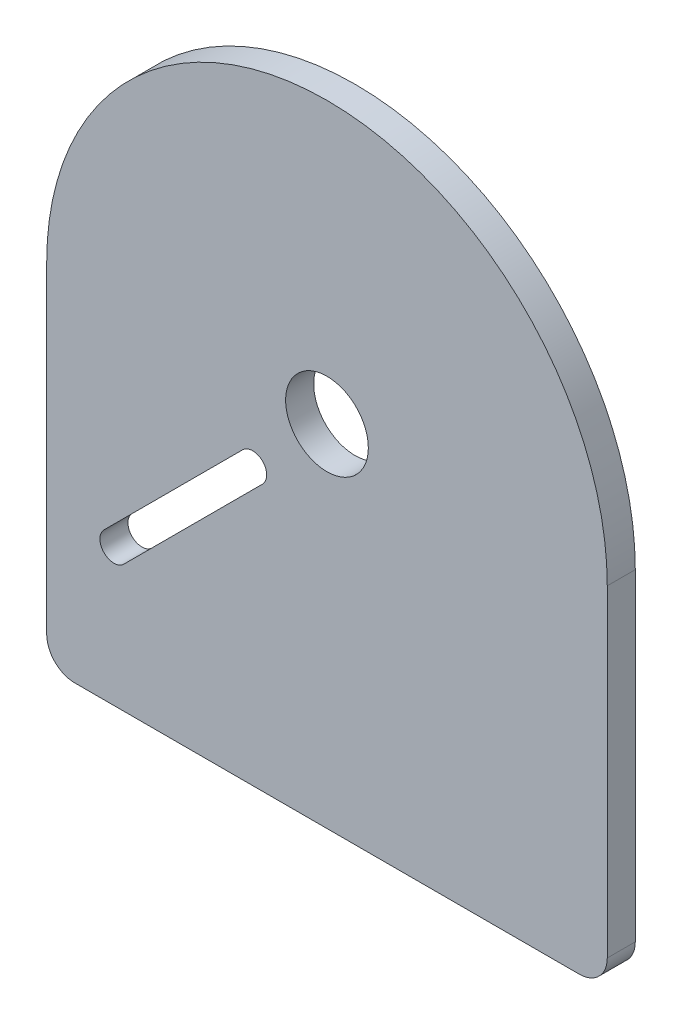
ISO-10303-21;
HEADER;
FILE_DESCRIPTION(('STEP AP214'),'2;1');
FILE_NAME('part.step','',(''),(''),'','','');
FILE_SCHEMA(('AUTOMOTIVE_DESIGN { 1 0 10303 214 1 1 1 1 }'));
ENDSEC;
DATA;
#1=APPLICATION_CONTEXT('core data for automotive mechanical design processes');
#2=APPLICATION_PROTOCOL_DEFINITION('international standard','automotive_design',2000,#1);
#3=PRODUCT_CONTEXT('',#1,'mechanical');
#4=PRODUCT('Part','Part','',(#3));
#5=PRODUCT_RELATED_PRODUCT_CATEGORY('part','',(#4));
#6=PRODUCT_DEFINITION_FORMATION('','',#4);
#7=PRODUCT_DEFINITION_CONTEXT('part definition',#1,'design');
#8=PRODUCT_DEFINITION('design','',#6,#7);
#9=PRODUCT_DEFINITION_SHAPE('','',#8);
#10=(LENGTH_UNIT() NAMED_UNIT(*) SI_UNIT(.MILLI.,.METRE.));
#11=(NAMED_UNIT(*) PLANE_ANGLE_UNIT() SI_UNIT($,.RADIAN.));
#12=(NAMED_UNIT(*) SI_UNIT($,.STERADIAN.) SOLID_ANGLE_UNIT());
#13=UNCERTAINTY_MEASURE_WITH_UNIT(LENGTH_MEASURE(1.E-05),#10,'distance_accuracy_value','');
#14=(GEOMETRIC_REPRESENTATION_CONTEXT(3) GLOBAL_UNCERTAINTY_ASSIGNED_CONTEXT((#13)) GLOBAL_UNIT_ASSIGNED_CONTEXT((#10,
#11,#12)) REPRESENTATION_CONTEXT('',''));
#15=CARTESIAN_POINT('',(0.,0.,0.));
#16=DIRECTION('',(0.,0.,1.));
#17=DIRECTION('',(1.,0.,0.));
#18=AXIS2_PLACEMENT_3D('',#15,#16,#17);
#19=CARTESIAN_POINT('',(-18.,-23.,1.99999999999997));
#20=DIRECTION('',(0.,0.,1.));
#21=DIRECTION('',(1.,0.,0.));
#22=AXIS2_PLACEMENT_3D('',#19,#20,#21);
#23=PLANE('',#22);
#24=CARTESIAN_POINT('',(0.,0.,2.));
#25=DIRECTION('',(0.,0.,1.));
#26=DIRECTION('',(1.,0.,0.));
#27=AXIS2_PLACEMENT_3D('',#24,#25,#26);
#28=CIRCLE('',#27,2.95);
#29=CARTESIAN_POINT('',(2.95,0.,2.));
#30=VERTEX_POINT('',#29);
#31=EDGE_CURVE('E150',#30,#30,#28,.T.);
#32=ORIENTED_EDGE('',*,*,#31,.F.);
#33=EDGE_LOOP('',(#32));
#34=FACE_BOUND('',#33,.T.);
#35=CARTESIAN_POINT('',(-18.,-23.,1.99999999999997));
#36=DIRECTION('',(0.,0.,1.));
#37=DIRECTION('',(1.,0.,0.));
#38=AXIS2_PLACEMENT_3D('',#35,#36,#37);
#39=CIRCLE('',#38,2.);
#40=CARTESIAN_POINT('',(-20.,-23.,1.99999999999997));
#41=VERTEX_POINT('',#40);
#42=CARTESIAN_POINT('',(-18.,-25.,1.99999999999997));
#43=VERTEX_POINT('',#42);
#44=EDGE_CURVE('E166',#41,#43,#39,.T.);
#45=ORIENTED_EDGE('',*,*,#44,.T.);
#46=DIRECTION('',(1.,0.,0.));
#47=VECTOR('',#46,1.);
#48=CARTESIAN_POINT('',(-18.,-25.,1.99999999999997));
#49=LINE('',#48,#47);
#50=CARTESIAN_POINT('',(18.,-25.,1.99999999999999));
#51=VERTEX_POINT('',#50);
#52=EDGE_CURVE('E169',#43,#51,#49,.T.);
#53=ORIENTED_EDGE('',*,*,#52,.T.);
#54=CARTESIAN_POINT('',(18.,-23.,1.99999999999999));
#55=DIRECTION('',(0.,0.,1.));
#56=DIRECTION('',(-1.,0.,0.));
#57=AXIS2_PLACEMENT_3D('',#54,#55,#56);
#58=CIRCLE('',#57,2.);
#59=CARTESIAN_POINT('',(20.,-23.,1.99999999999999));
#60=VERTEX_POINT('',#59);
#61=EDGE_CURVE('E171',#51,#60,#58,.T.);
#62=ORIENTED_EDGE('',*,*,#61,.T.);
#63=DIRECTION('',(0.,0.999999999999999,0.));
#64=VECTOR('',#63,1.);
#65=CARTESIAN_POINT('',(20.,0.,2.));
#66=LINE('',#65,#64);
#67=CARTESIAN_POINT('',(20.,0.,2.));
#68=VERTEX_POINT('',#67);
#69=EDGE_CURVE('E173',#60,#68,#66,.T.);
#70=ORIENTED_EDGE('',*,*,#69,.T.);
#71=CARTESIAN_POINT('',(0.,0.,2.));
#72=DIRECTION('',(0.,0.,1.));
#73=DIRECTION('',(1.,0.,0.));
#74=AXIS2_PLACEMENT_3D('',#71,#72,#73);
#75=CIRCLE('',#74,20.);
#76=CARTESIAN_POINT('',(-20.,0.,1.99999999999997));
#77=VERTEX_POINT('',#76);
#78=EDGE_CURVE('E175',#68,#77,#75,.T.);
#79=ORIENTED_EDGE('',*,*,#78,.T.);
#80=DIRECTION('',(0.,-0.999999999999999,0.));
#81=VECTOR('',#80,1.);
#82=CARTESIAN_POINT('',(-20.,0.,1.99999999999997));
#83=LINE('',#82,#81);
#84=EDGE_CURVE('E177',#77,#41,#83,.T.);
#85=ORIENTED_EDGE('',*,*,#84,.T.);
#86=EDGE_LOOP('',(#45,#53,#62,#70,#79,#85));
#87=FACE_BOUND('',#86,.T.);
#88=DIRECTION('',(-0.70710678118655,-0.707106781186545,0.));
#89=VECTOR('',#88,1.);
#90=CARTESIAN_POINT('',(-6.01040764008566,-4.59619407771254,1.99999999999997));
#91=LINE('',#90,#89);
#92=CARTESIAN_POINT('',(-6.01040764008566,-4.59619407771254,1.99999999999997));
#93=VERTEX_POINT('',#92);
#94=CARTESIAN_POINT('',(-15.9099025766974,-14.4956890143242,1.99999999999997));
#95=VERTEX_POINT('',#94);
#96=EDGE_CURVE('E138',#93,#95,#91,.T.);
#97=ORIENTED_EDGE('',*,*,#96,.F.);
#98=CARTESIAN_POINT('',(-5.30330085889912,-5.30330085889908,1.99999999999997));
#99=DIRECTION('',(0.,0.,1.));
#100=DIRECTION('',(1.,0.,0.));
#101=AXIS2_PLACEMENT_3D('',#98,#99,#100);
#102=CIRCLE('',#101,1.);
#103=CARTESIAN_POINT('',(-4.59619407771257,-6.01040764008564,1.99999999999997));
#104=VERTEX_POINT('',#103);
#105=EDGE_CURVE('E127',#104,#93,#102,.T.);
#106=ORIENTED_EDGE('',*,*,#105,.F.);
#107=DIRECTION('',(0.707106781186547,0.707106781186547,0.));
#108=VECTOR('',#107,1.);
#109=CARTESIAN_POINT('',(-14.4956890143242,-15.9099025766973,1.99999999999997));
#110=LINE('',#109,#108);
#111=CARTESIAN_POINT('',(-14.4956890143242,-15.9099025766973,1.99999999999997));
#112=VERTEX_POINT('',#111);
#113=EDGE_CURVE('E142',#112,#104,#110,.T.);
#114=ORIENTED_EDGE('',*,*,#113,.F.);
#115=CARTESIAN_POINT('',(-15.2027957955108,-15.2027957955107,1.99999999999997));
#116=DIRECTION('',(0.,0.,1.));
#117=DIRECTION('',(1.,0.,0.));
#118=AXIS2_PLACEMENT_3D('',#115,#116,#117);
#119=CIRCLE('',#118,1.00000000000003);
#120=EDGE_CURVE('E140',#95,#112,#119,.T.);
#121=ORIENTED_EDGE('',*,*,#120,.F.);
#122=EDGE_LOOP('',(#97,#106,#114,#121));
#123=FACE_BOUND('',#122,.T.);
#124=ADVANCED_FACE('F35',(#34,#87,#123),#23,.T.);
#125=CARTESIAN_POINT('',(-18.,-23.,0.));
#126=DIRECTION('',(0.,0.,1.));
#127=DIRECTION('',(1.,0.,0.));
#128=AXIS2_PLACEMENT_3D('',#125,#126,#127);
#129=PLANE('',#128);
#130=CARTESIAN_POINT('',(0.,0.,0.));
#131=DIRECTION('',(0.,0.,1.));
#132=DIRECTION('',(1.,0.,0.));
#133=AXIS2_PLACEMENT_3D('',#130,#131,#132);
#134=CIRCLE('',#133,2.95);
#135=CARTESIAN_POINT('',(2.95,0.,0.));
#136=VERTEX_POINT('',#135);
#137=EDGE_CURVE('E128',#136,#136,#134,.T.);
#138=ORIENTED_EDGE('',*,*,#137,.T.);
#139=EDGE_LOOP('',(#138));
#140=FACE_BOUND('',#139,.T.);
#141=CARTESIAN_POINT('',(-18.,-23.,0.));
#142=DIRECTION('',(0.,0.,1.));
#143=DIRECTION('',(1.,0.,0.));
#144=AXIS2_PLACEMENT_3D('',#141,#142,#143);
#145=CIRCLE('',#144,2.);
#146=CARTESIAN_POINT('',(-20.,-23.,0.));
#147=VERTEX_POINT('',#146);
#148=CARTESIAN_POINT('',(-18.,-25.,0.));
#149=VERTEX_POINT('',#148);
#150=EDGE_CURVE('E153',#147,#149,#145,.T.);
#151=ORIENTED_EDGE('',*,*,#150,.F.);
#152=DIRECTION('',(0.,-0.999999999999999,0.));
#153=VECTOR('',#152,1.);
#154=CARTESIAN_POINT('',(-20.,0.,0.));
#155=LINE('',#154,#153);
#156=CARTESIAN_POINT('',(-20.,0.,0.));
#157=VERTEX_POINT('',#156);
#158=EDGE_CURVE('E164',#157,#147,#155,.T.);
#159=ORIENTED_EDGE('',*,*,#158,.F.);
#160=CARTESIAN_POINT('',(0.,0.,0.));
#161=DIRECTION('',(0.,0.,1.));
#162=DIRECTION('',(1.,0.,0.));
#163=AXIS2_PLACEMENT_3D('',#160,#161,#162);
#164=CIRCLE('',#163,20.);
#165=CARTESIAN_POINT('',(20.,0.,0.));
#166=VERTEX_POINT('',#165);
#167=EDGE_CURVE('E162',#166,#157,#164,.T.);
#168=ORIENTED_EDGE('',*,*,#167,.F.);
#169=DIRECTION('',(0.,0.999999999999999,0.));
#170=VECTOR('',#169,1.);
#171=CARTESIAN_POINT('',(20.,0.,0.));
#172=LINE('',#171,#170);
#173=CARTESIAN_POINT('',(20.,-23.,0.));
#174=VERTEX_POINT('',#173);
#175=EDGE_CURVE('E160',#174,#166,#172,.T.);
#176=ORIENTED_EDGE('',*,*,#175,.F.);
#177=CARTESIAN_POINT('',(18.,-23.,0.));
#178=DIRECTION('',(0.,0.,1.));
#179=DIRECTION('',(-1.,0.,0.));
#180=AXIS2_PLACEMENT_3D('',#177,#178,#179);
#181=CIRCLE('',#180,2.);
#182=CARTESIAN_POINT('',(18.,-25.,0.));
#183=VERTEX_POINT('',#182);
#184=EDGE_CURVE('E158',#183,#174,#181,.T.);
#185=ORIENTED_EDGE('',*,*,#184,.F.);
#186=DIRECTION('',(1.,0.,0.));
#187=VECTOR('',#186,1.);
#188=CARTESIAN_POINT('',(-18.,-25.,0.));
#189=LINE('',#188,#187);
#190=EDGE_CURVE('E156',#149,#183,#189,.T.);
#191=ORIENTED_EDGE('',*,*,#190,.F.);
#192=EDGE_LOOP('',(#151,#159,#168,#176,#185,#191));
#193=FACE_BOUND('',#192,.T.);
#194=CARTESIAN_POINT('',(-5.30330085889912,-5.30330085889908,0.));
#195=DIRECTION('',(0.,0.,1.));
#196=DIRECTION('',(1.,0.,0.));
#197=AXIS2_PLACEMENT_3D('',#194,#195,#196);
#198=CIRCLE('',#197,1.);
#199=CARTESIAN_POINT('',(-4.59619407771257,-6.01040764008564,0.));
#200=VERTEX_POINT('',#199);
#201=CARTESIAN_POINT('',(-6.01040764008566,-4.59619407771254,0.));
#202=VERTEX_POINT('',#201);
#203=EDGE_CURVE('E58',#200,#202,#198,.T.);
#204=ORIENTED_EDGE('',*,*,#203,.T.);
#205=DIRECTION('',(-0.70710678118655,-0.707106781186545,0.));
#206=VECTOR('',#205,1.);
#207=CARTESIAN_POINT('',(-6.01040764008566,-4.59619407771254,0.));
#208=LINE('',#207,#206);
#209=CARTESIAN_POINT('',(-15.9099025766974,-14.4956890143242,0.));
#210=VERTEX_POINT('',#209);
#211=EDGE_CURVE('E114',#202,#210,#208,.T.);
#212=ORIENTED_EDGE('',*,*,#211,.T.);
#213=CARTESIAN_POINT('',(-15.2027957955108,-15.2027957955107,0.));
#214=DIRECTION('',(0.,0.,1.));
#215=DIRECTION('',(1.,0.,0.));
#216=AXIS2_PLACEMENT_3D('',#213,#214,#215);
#217=CIRCLE('',#216,1.00000000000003);
#218=CARTESIAN_POINT('',(-14.4956890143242,-15.9099025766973,0.));
#219=VERTEX_POINT('',#218);
#220=EDGE_CURVE('E123',#210,#219,#217,.T.);
#221=ORIENTED_EDGE('',*,*,#220,.T.);
#222=DIRECTION('',(0.707106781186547,0.707106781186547,0.));
#223=VECTOR('',#222,1.);
#224=CARTESIAN_POINT('',(-14.4956890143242,-15.9099025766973,0.));
#225=LINE('',#224,#223);
#226=EDGE_CURVE('E132',#219,#200,#225,.T.);
#227=ORIENTED_EDGE('',*,*,#226,.T.);
#228=EDGE_LOOP('',(#204,#212,#221,#227));
#229=FACE_BOUND('',#228,.T.);
#230=ADVANCED_FACE('F131',(#140,#193,#229),#129,.F.);
#231=CARTESIAN_POINT('',(-18.,-23.,1.99999999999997));
#232=DIRECTION('',(0.,0.,-1.));
#233=DIRECTION('',(-1.,0.,0.));
#234=AXIS2_PLACEMENT_3D('',#231,#232,#233);
#235=CYLINDRICAL_SURFACE('',#234,2.);
#236=ORIENTED_EDGE('',*,*,#150,.T.);
#237=DIRECTION('',(0.,0.,-1.));
#238=VECTOR('',#237,1.);
#239=CARTESIAN_POINT('',(-18.,-25.,1.99999999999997));
#240=LINE('',#239,#238);
#241=EDGE_CURVE('E11',#43,#149,#240,.T.);
#242=ORIENTED_EDGE('',*,*,#241,.F.);
#243=ORIENTED_EDGE('',*,*,#44,.F.);
#244=DIRECTION('',(0.,0.,-1.));
#245=VECTOR('',#244,1.);
#246=CARTESIAN_POINT('',(-20.,-23.,1.99999999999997));
#247=LINE('',#246,#245);
#248=EDGE_CURVE('E179',#41,#147,#247,.T.);
#249=ORIENTED_EDGE('',*,*,#248,.T.);
#250=EDGE_LOOP('',(#236,#242,#243,#249));
#251=FACE_BOUND('',#250,.T.);
#252=ADVANCED_FACE('F37',(#251),#235,.T.);
#253=CARTESIAN_POINT('',(-18.,-25.,1.99999999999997));
#254=DIRECTION('',(0.,0.999999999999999,0.));
#255=DIRECTION('',(0.,0.,1.));
#256=AXIS2_PLACEMENT_3D('',#253,#254,#255);
#257=PLANE('',#256);
#258=ORIENTED_EDGE('',*,*,#190,.T.);
#259=DIRECTION('',(0.,0.,-1.));
#260=VECTOR('',#259,1.);
#261=CARTESIAN_POINT('',(18.,-25.,1.99999999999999));
#262=LINE('',#261,#260);
#263=EDGE_CURVE('E43',#51,#183,#262,.T.);
#264=ORIENTED_EDGE('',*,*,#263,.F.);
#265=ORIENTED_EDGE('',*,*,#52,.F.);
#266=ORIENTED_EDGE('',*,*,#241,.T.);
#267=EDGE_LOOP('',(#258,#264,#265,#266));
#268=FACE_BOUND('',#267,.T.);
#269=ADVANCED_FACE('F217',(#268),#257,.F.);
#270=CARTESIAN_POINT('',(18.,-23.,1.99999999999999));
#271=DIRECTION('',(0.,0.,-1.));
#272=DIRECTION('',(-1.,0.,0.));
#273=AXIS2_PLACEMENT_3D('',#270,#271,#272);
#274=CYLINDRICAL_SURFACE('',#273,2.);
#275=ORIENTED_EDGE('',*,*,#184,.T.);
#276=DIRECTION('',(0.,0.,-1.));
#277=VECTOR('',#276,1.);
#278=CARTESIAN_POINT('',(20.,-23.,1.99999999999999));
#279=LINE('',#278,#277);
#280=EDGE_CURVE('E188',#60,#174,#279,.T.);
#281=ORIENTED_EDGE('',*,*,#280,.F.);
#282=ORIENTED_EDGE('',*,*,#61,.F.);
#283=ORIENTED_EDGE('',*,*,#263,.T.);
#284=EDGE_LOOP('',(#275,#281,#282,#283));
#285=FACE_BOUND('',#284,.T.);
#286=ADVANCED_FACE('F195',(#285),#274,.T.);
#287=CARTESIAN_POINT('',(20.,0.,2.));
#288=DIRECTION('',(-1.,0.,0.));
#289=DIRECTION('',(0.,-0.999999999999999,0.));
#290=AXIS2_PLACEMENT_3D('',#287,#288,#289);
#291=PLANE('',#290);
#292=ORIENTED_EDGE('',*,*,#175,.T.);
#293=DIRECTION('',(0.,0.,-1.));
#294=VECTOR('',#293,1.);
#295=CARTESIAN_POINT('',(20.,0.,2.));
#296=LINE('',#295,#294);
#297=EDGE_CURVE('E185',#68,#166,#296,.T.);
#298=ORIENTED_EDGE('',*,*,#297,.F.);
#299=ORIENTED_EDGE('',*,*,#69,.F.);
#300=ORIENTED_EDGE('',*,*,#280,.T.);
#301=EDGE_LOOP('',(#292,#298,#299,#300));
#302=FACE_BOUND('',#301,.T.);
#303=ADVANCED_FACE('F205',(#302),#291,.F.);
#304=CARTESIAN_POINT('',(0.,0.,2.));
#305=DIRECTION('',(0.,0.,-1.));
#306=DIRECTION('',(-1.,0.,0.));
#307=AXIS2_PLACEMENT_3D('',#304,#305,#306);
#308=CYLINDRICAL_SURFACE('',#307,20.);
#309=ORIENTED_EDGE('',*,*,#167,.T.);
#310=DIRECTION('',(0.,0.,-1.));
#311=VECTOR('',#310,1.);
#312=CARTESIAN_POINT('',(-20.,0.,1.99999999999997));
#313=LINE('',#312,#311);
#314=EDGE_CURVE('E182',#77,#157,#313,.T.);
#315=ORIENTED_EDGE('',*,*,#314,.F.);
#316=ORIENTED_EDGE('',*,*,#78,.F.);
#317=ORIENTED_EDGE('',*,*,#297,.T.);
#318=EDGE_LOOP('',(#309,#315,#316,#317));
#319=FACE_BOUND('',#318,.T.);
#320=ADVANCED_FACE('F209',(#319),#308,.T.);
#321=CARTESIAN_POINT('',(-20.,0.,1.99999999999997));
#322=DIRECTION('',(1.,0.,0.));
#323=DIRECTION('',(0.,0.,-1.));
#324=AXIS2_PLACEMENT_3D('',#321,#322,#323);
#325=PLANE('',#324);
#326=ORIENTED_EDGE('',*,*,#158,.T.);
#327=ORIENTED_EDGE('',*,*,#248,.F.);
#328=ORIENTED_EDGE('',*,*,#84,.F.);
#329=ORIENTED_EDGE('',*,*,#314,.T.);
#330=EDGE_LOOP('',(#326,#327,#328,#329));
#331=FACE_BOUND('',#330,.T.);
#332=ADVANCED_FACE('F220',(#331),#325,.F.);
#333=CARTESIAN_POINT('',(0.,0.,2.));
#334=DIRECTION('',(0.,0.,-1.));
#335=DIRECTION('',(-1.,0.,0.));
#336=AXIS2_PLACEMENT_3D('',#333,#334,#335);
#337=CYLINDRICAL_SURFACE('',#336,2.95);
#338=ORIENTED_EDGE('',*,*,#31,.T.);
#339=EDGE_LOOP('',(#338));
#340=FACE_BOUND('',#339,.T.);
#341=ORIENTED_EDGE('',*,*,#137,.F.);
#342=EDGE_LOOP('',(#341));
#343=FACE_BOUND('',#342,.T.);
#344=ADVANCED_FACE('F222',(#340,#343),#337,.F.);
#345=CARTESIAN_POINT('',(-5.30330085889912,-5.30330085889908,1.99999999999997));
#346=DIRECTION('',(0.,0.,-1.));
#347=DIRECTION('',(-1.,0.,0.));
#348=AXIS2_PLACEMENT_3D('',#345,#346,#347);
#349=CYLINDRICAL_SURFACE('',#348,1.);
#350=ORIENTED_EDGE('',*,*,#203,.F.);
#351=DIRECTION('',(0.,0.,-1.));
#352=VECTOR('',#351,1.);
#353=CARTESIAN_POINT('',(-4.59619407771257,-6.01040764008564,1.99999999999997));
#354=LINE('',#353,#352);
#355=EDGE_CURVE('E144',#104,#200,#354,.T.);
#356=ORIENTED_EDGE('',*,*,#355,.F.);
#357=ORIENTED_EDGE('',*,*,#105,.T.);
#358=DIRECTION('',(0.,0.,-1.));
#359=VECTOR('',#358,1.);
#360=CARTESIAN_POINT('',(-6.01040764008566,-4.59619407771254,1.99999999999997));
#361=LINE('',#360,#359);
#362=EDGE_CURVE('E116',#93,#202,#361,.T.);
#363=ORIENTED_EDGE('',*,*,#362,.T.);
#364=EDGE_LOOP('',(#350,#356,#357,#363));
#365=FACE_BOUND('',#364,.T.);
#366=ADVANCED_FACE('F125',(#365),#349,.F.);
#367=CARTESIAN_POINT('',(-6.01040764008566,-4.59619407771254,1.99999999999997));
#368=DIRECTION('',(0.707106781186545,-0.707106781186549,0.));
#369=DIRECTION('',(0.70710678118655,0.707106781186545,0.));
#370=AXIS2_PLACEMENT_3D('',#367,#368,#369);
#371=PLANE('',#370);
#372=ORIENTED_EDGE('',*,*,#211,.F.);
#373=ORIENTED_EDGE('',*,*,#362,.F.);
#374=ORIENTED_EDGE('',*,*,#96,.T.);
#375=DIRECTION('',(0.,0.,-1.));
#376=VECTOR('',#375,1.);
#377=CARTESIAN_POINT('',(-15.9099025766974,-14.4956890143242,1.99999999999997));
#378=LINE('',#377,#376);
#379=EDGE_CURVE('E119',#95,#210,#378,.T.);
#380=ORIENTED_EDGE('',*,*,#379,.T.);
#381=EDGE_LOOP('',(#372,#373,#374,#380));
#382=FACE_BOUND('',#381,.T.);
#383=ADVANCED_FACE('F115',(#382),#371,.T.);
#384=CARTESIAN_POINT('',(-15.2027957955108,-15.2027957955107,1.99999999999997));
#385=DIRECTION('',(0.,0.,-1.));
#386=DIRECTION('',(-1.,0.,0.));
#387=AXIS2_PLACEMENT_3D('',#384,#385,#386);
#388=CYLINDRICAL_SURFACE('',#387,1.00000000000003);
#389=ORIENTED_EDGE('',*,*,#220,.F.);
#390=ORIENTED_EDGE('',*,*,#379,.F.);
#391=ORIENTED_EDGE('',*,*,#120,.T.);
#392=DIRECTION('',(0.,0.,-1.));
#393=VECTOR('',#392,1.);
#394=CARTESIAN_POINT('',(-14.4956890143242,-15.9099025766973,1.99999999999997));
#395=LINE('',#394,#393);
#396=EDGE_CURVE('E50',#112,#219,#395,.T.);
#397=ORIENTED_EDGE('',*,*,#396,.T.);
#398=EDGE_LOOP('',(#389,#390,#391,#397));
#399=FACE_BOUND('',#398,.T.);
#400=ADVANCED_FACE('F245',(#399),#388,.F.);
#401=CARTESIAN_POINT('',(-14.4956890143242,-15.9099025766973,1.99999999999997));
#402=DIRECTION('',(-0.707106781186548,0.707106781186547,0.));
#403=DIRECTION('',(-0.707106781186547,-0.707106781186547,0.));
#404=AXIS2_PLACEMENT_3D('',#401,#402,#403);
#405=PLANE('',#404);
#406=ORIENTED_EDGE('',*,*,#226,.F.);
#407=ORIENTED_EDGE('',*,*,#396,.F.);
#408=ORIENTED_EDGE('',*,*,#113,.T.);
#409=ORIENTED_EDGE('',*,*,#355,.T.);
#410=EDGE_LOOP('',(#406,#407,#408,#409));
#411=FACE_BOUND('',#410,.T.);
#412=ADVANCED_FACE('F248',(#411),#405,.T.);
#413=CLOSED_SHELL('',(#124,#230,#252,#269,#286,#303,#320,#332,#344,#366,#383,#400,#412));
#414=MANIFOLD_SOLID_BREP('B2',#413);
#415=ADVANCED_BREP_SHAPE_REPRESENTATION('',(#18,#414),#14);
#416=SHAPE_DEFINITION_REPRESENTATION(#9,#415);
ENDSEC;
END-ISO-10303-21;
